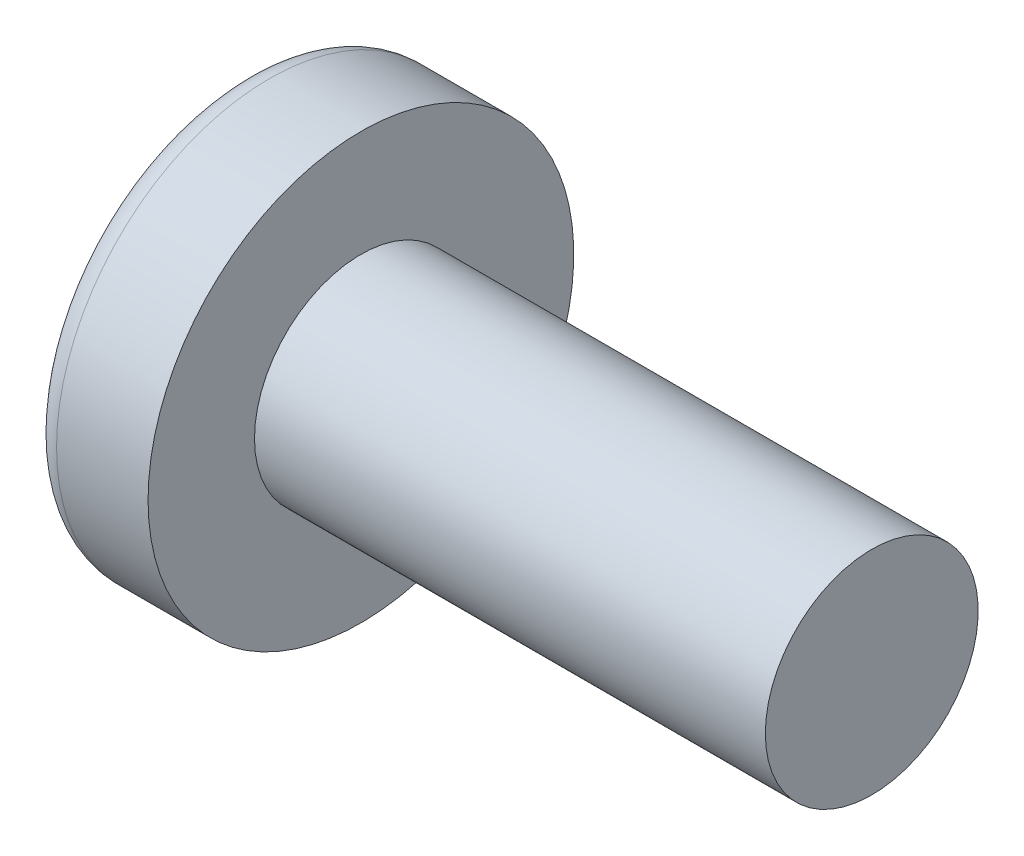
ISO-10303-21;
HEADER;
FILE_DESCRIPTION(('STEP AP214'),'2;1');
FILE_NAME('part.step','',(''),(''),'','','');
FILE_SCHEMA(('AUTOMOTIVE_DESIGN { 1 0 10303 214 1 1 1 1 }'));
ENDSEC;
DATA;
#1=APPLICATION_CONTEXT('core data for automotive mechanical design processes');
#2=APPLICATION_PROTOCOL_DEFINITION('international standard','automotive_design',2000,#1);
#3=PRODUCT_CONTEXT('',#1,'mechanical');
#4=PRODUCT('Part','Part','',(#3));
#5=PRODUCT_RELATED_PRODUCT_CATEGORY('part','',(#4));
#6=PRODUCT_DEFINITION_FORMATION('','',#4);
#7=PRODUCT_DEFINITION_CONTEXT('part definition',#1,'design');
#8=PRODUCT_DEFINITION('design','',#6,#7);
#9=PRODUCT_DEFINITION_SHAPE('','',#8);
#10=(LENGTH_UNIT() NAMED_UNIT(*) SI_UNIT(.MILLI.,.METRE.));
#11=(NAMED_UNIT(*) PLANE_ANGLE_UNIT() SI_UNIT($,.RADIAN.));
#12=(NAMED_UNIT(*) SI_UNIT($,.STERADIAN.) SOLID_ANGLE_UNIT());
#13=UNCERTAINTY_MEASURE_WITH_UNIT(LENGTH_MEASURE(1.E-05),#10,'distance_accuracy_value','');
#14=(GEOMETRIC_REPRESENTATION_CONTEXT(3) GLOBAL_UNCERTAINTY_ASSIGNED_CONTEXT((#13)) GLOBAL_UNIT_ASSIGNED_CONTEXT((#10,
#11,#12)) REPRESENTATION_CONTEXT('',''));
#15=CARTESIAN_POINT('',(0.,0.,0.));
#16=DIRECTION('',(0.,0.,1.));
#17=DIRECTION('',(1.,0.,0.));
#18=AXIS2_PLACEMENT_3D('',#15,#16,#17);
#19=CARTESIAN_POINT('',(4.,0.,0.));
#20=DIRECTION('',(-1.,0.,0.));
#21=DIRECTION('',(0.,1.,0.));
#22=AXIS2_PLACEMENT_3D('',#19,#20,#21);
#23=SPHERICAL_SURFACE('',#22,4.);
#24=CARTESIAN_POINT('',(0.783897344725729,0.,0.));
#25=DIRECTION('',(-1.,0.,0.));
#26=DIRECTION('',(0.,0.,1.));
#27=AXIS2_PLACEMENT_3D('',#24,#25,#26);
#28=CIRCLE('',#27,2.37837837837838);
#29=CARTESIAN_POINT('',(0.783897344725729,0.,2.37837837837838));
#30=VERTEX_POINT('',#29);
#31=EDGE_CURVE('E159',#30,#30,#28,.T.);
#32=ORIENTED_EDGE('',*,*,#31,.T.);
#33=EDGE_LOOP('',(#32));
#34=FACE_BOUND('',#33,.T.);
#35=CARTESIAN_POINT('',(3.98786118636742,-0.106127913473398,0.));
#36=DIRECTION('',(-0.11363816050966,-0.993522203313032,0.));
#37=DIRECTION('',(0.993522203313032,-0.11363816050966,0.));
#38=AXIS2_PLACEMENT_3D('',#35,#36,#37);
#39=CIRCLE('',#38,3.99857343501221);
#40=CARTESIAN_POINT('',(0.195539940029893,0.327634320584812,1.19110847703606));
#41=VERTEX_POINT('',#40);
#42=CARTESIAN_POINT('',(0.0301382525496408,0.346552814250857,0.346552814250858));
#43=VERTEX_POINT('',#42);
#44=EDGE_CURVE('E134',#41,#43,#39,.T.);
#45=ORIENTED_EDGE('',*,*,#44,.F.);
#46=CARTESIAN_POINT('',(3.17784904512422,0.,-1.07973473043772));
#47=DIRECTION('',(0.605808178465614,0.,0.795610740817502));
#48=DIRECTION('',(0.795610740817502,0.,-0.605808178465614));
#49=AXIS2_PLACEMENT_3D('',#46,#47,#48);
#50=CIRCLE('',#49,3.76274377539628);
#51=CARTESIAN_POINT('',(0.195539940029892,-0.32763432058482,1.19110847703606));
#52=VERTEX_POINT('',#51);
#53=EDGE_CURVE('E127',#41,#52,#50,.T.);
#54=ORIENTED_EDGE('',*,*,#53,.T.);
#55=CARTESIAN_POINT('',(3.98786118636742,0.106127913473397,0.));
#56=DIRECTION('',(-0.11363816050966,0.993522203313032,0.));
#57=DIRECTION('',(-0.993522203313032,-0.11363816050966,0.));
#58=AXIS2_PLACEMENT_3D('',#55,#56,#57);
#59=CIRCLE('',#58,3.99857343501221);
#60=CARTESIAN_POINT('',(0.0301382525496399,-0.346552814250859,0.346552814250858));
#61=VERTEX_POINT('',#60);
#62=EDGE_CURVE('E201',#61,#52,#59,.T.);
#63=ORIENTED_EDGE('',*,*,#62,.F.);
#64=CARTESIAN_POINT('',(3.98786118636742,0.,-0.106127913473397));
#65=DIRECTION('',(-0.11363816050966,0.,-0.993522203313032));
#66=DIRECTION('',(-0.993522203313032,0.,0.11363816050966));
#67=AXIS2_PLACEMENT_3D('',#64,#65,#66);
#68=CIRCLE('',#67,3.99857343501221);
#69=CARTESIAN_POINT('',(0.195539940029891,-1.19110847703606,0.327634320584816));
#70=VERTEX_POINT('',#69);
#71=EDGE_CURVE('E176',#70,#61,#68,.T.);
#72=ORIENTED_EDGE('',*,*,#71,.F.);
#73=CARTESIAN_POINT('',(3.17784904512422,1.07973473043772,0.));
#74=DIRECTION('',(0.605808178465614,-0.795610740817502,0.));
#75=DIRECTION('',(0.795610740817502,0.605808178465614,0.));
#76=AXIS2_PLACEMENT_3D('',#73,#74,#75);
#77=CIRCLE('',#76,3.76274377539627);
#78=CARTESIAN_POINT('',(0.195539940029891,-1.19110847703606,-0.327634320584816));
#79=VERTEX_POINT('',#78);
#80=EDGE_CURVE('E172',#70,#79,#77,.T.);
#81=ORIENTED_EDGE('',*,*,#80,.T.);
#82=CARTESIAN_POINT('',(3.98786118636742,0.,0.106127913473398));
#83=DIRECTION('',(-0.11363816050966,0.,0.993522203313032));
#84=DIRECTION('',(0.993522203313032,0.,0.11363816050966));
#85=AXIS2_PLACEMENT_3D('',#82,#83,#84);
#86=CIRCLE('',#85,3.99857343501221);
#87=CARTESIAN_POINT('',(0.0301382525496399,-0.346552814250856,-0.346552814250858));
#88=VERTEX_POINT('',#87);
#89=EDGE_CURVE('E55',#88,#79,#86,.T.);
#90=ORIENTED_EDGE('',*,*,#89,.F.);
#91=CARTESIAN_POINT('',(0.195539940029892,-0.327634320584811,-1.19110847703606));
#92=VERTEX_POINT('',#91);
#93=EDGE_CURVE('E198',#92,#88,#59,.T.);
#94=ORIENTED_EDGE('',*,*,#93,.F.);
#95=CARTESIAN_POINT('',(3.17784904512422,0.,1.07973473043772));
#96=DIRECTION('',(0.605808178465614,0.,-0.795610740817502));
#97=DIRECTION('',(-0.795610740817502,0.,-0.605808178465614));
#98=AXIS2_PLACEMENT_3D('',#95,#96,#97);
#99=CIRCLE('',#98,3.76274377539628);
#100=CARTESIAN_POINT('',(0.195539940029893,0.32763432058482,-1.19110847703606));
#101=VERTEX_POINT('',#100);
#102=EDGE_CURVE('E191',#92,#101,#99,.T.);
#103=ORIENTED_EDGE('',*,*,#102,.T.);
#104=CARTESIAN_POINT('',(0.0301382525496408,0.346552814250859,-0.346552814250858));
#105=VERTEX_POINT('',#104);
#106=EDGE_CURVE('E112',#105,#101,#39,.T.);
#107=ORIENTED_EDGE('',*,*,#106,.F.);
#108=CARTESIAN_POINT('',(0.195539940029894,1.19110847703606,-0.327634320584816));
#109=VERTEX_POINT('',#108);
#110=EDGE_CURVE('E48',#109,#105,#86,.T.);
#111=ORIENTED_EDGE('',*,*,#110,.F.);
#112=CARTESIAN_POINT('',(3.17784904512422,-1.07973473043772,0.));
#113=DIRECTION('',(0.605808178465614,0.795610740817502,0.));
#114=DIRECTION('',(-0.795610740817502,0.605808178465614,0.));
#115=AXIS2_PLACEMENT_3D('',#112,#113,#114);
#116=CIRCLE('',#115,3.76274377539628);
#117=CARTESIAN_POINT('',(0.195539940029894,1.19110847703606,0.327634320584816));
#118=VERTEX_POINT('',#117);
#119=EDGE_CURVE('E11',#109,#118,#116,.T.);
#120=ORIENTED_EDGE('',*,*,#119,.T.);
#121=EDGE_CURVE('E175',#43,#118,#68,.T.);
#122=ORIENTED_EDGE('',*,*,#121,.F.);
#123=EDGE_LOOP('',(#45,#54,#63,#72,#81,#90,#94,#103,#107,#111,#120,#122));
#124=FACE_BOUND('',#123,.T.);
#125=ADVANCED_FACE('F40',(#34,#124),#23,.T.);
#126=CARTESIAN_POINT('',(1.75982832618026,0.,-0.148712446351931));
#127=DIRECTION('',(-0.11363816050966,0.,0.993522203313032));
#128=DIRECTION('',(0.993522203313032,0.,0.11363816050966));
#129=AXIS2_PLACEMENT_3D('',#126,#127,#128);
#130=PLANE('',#129);
#131=ORIENTED_EDGE('',*,*,#110,.T.);
#132=DIRECTION('',(0.987168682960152,-0.112911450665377,0.112911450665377));
#133=VECTOR('',#132,1.);
#134=CARTESIAN_POINT('',(1.77640420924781,0.146816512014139,-0.146816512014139));
#135=LINE('',#134,#133);
#136=CARTESIAN_POINT('',(1.53,0.175000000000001,-0.174999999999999));
#137=VERTEX_POINT('',#136);
#138=EDGE_CURVE('E110',#105,#137,#135,.T.);
#139=ORIENTED_EDGE('',*,*,#138,.T.);
#140=DIRECTION('',(0.792336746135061,-0.603315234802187,0.0906267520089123));
#141=VECTOR('',#140,1.);
#142=CARTESIAN_POINT('',(0.,1.34,-0.35));
#143=LINE('',#142,#141);
#144=EDGE_CURVE('E132',#109,#137,#143,.T.);
#145=ORIENTED_EDGE('',*,*,#144,.F.);
#146=EDGE_LOOP('',(#131,#139,#145));
#147=FACE_BOUND('',#146,.T.);
#148=ADVANCED_FACE('F131',(#147),#130,.T.);
#149=DIRECTION('',(0.792336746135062,0.603315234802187,0.0906267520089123));
#150=VECTOR('',#149,1.);
#151=CARTESIAN_POINT('',(0.,-1.34,-0.35));
#152=LINE('',#151,#150);
#153=CARTESIAN_POINT('',(1.53,-0.175,-0.175));
#154=VERTEX_POINT('',#153);
#155=EDGE_CURVE('E153',#79,#154,#152,.T.);
#156=ORIENTED_EDGE('',*,*,#155,.T.);
#157=DIRECTION('',(-0.987168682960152,-0.112911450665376,-0.112911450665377));
#158=VECTOR('',#157,1.);
#159=CARTESIAN_POINT('',(1.77640420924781,-0.146816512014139,-0.146816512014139));
#160=LINE('',#159,#158);
#161=EDGE_CURVE('E199',#154,#88,#160,.T.);
#162=ORIENTED_EDGE('',*,*,#161,.T.);
#163=ORIENTED_EDGE('',*,*,#89,.T.);
#164=EDGE_LOOP('',(#156,#162,#163));
#165=FACE_BOUND('',#164,.T.);
#166=ADVANCED_FACE('F232',(#165),#130,.T.);
#167=CARTESIAN_POINT('',(1.75982832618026,0.,0.148712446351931));
#168=DIRECTION('',(-0.11363816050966,0.,-0.993522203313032));
#169=DIRECTION('',(-0.993522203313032,0.,0.11363816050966));
#170=AXIS2_PLACEMENT_3D('',#167,#168,#169);
#171=PLANE('',#170);
#172=DIRECTION('',(0.792336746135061,-0.603315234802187,-0.0906267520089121));
#173=VECTOR('',#172,1.);
#174=CARTESIAN_POINT('',(0.,1.34,0.35));
#175=LINE('',#174,#173);
#176=CARTESIAN_POINT('',(1.53,0.175,0.175));
#177=VERTEX_POINT('',#176);
#178=EDGE_CURVE('E139',#118,#177,#175,.T.);
#179=ORIENTED_EDGE('',*,*,#178,.T.);
#180=DIRECTION('',(-0.987168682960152,0.112911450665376,0.112911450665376));
#181=VECTOR('',#180,1.);
#182=CARTESIAN_POINT('',(1.77640420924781,0.146816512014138,0.146816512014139));
#183=LINE('',#182,#181);
#184=EDGE_CURVE('E187',#177,#43,#183,.T.);
#185=ORIENTED_EDGE('',*,*,#184,.T.);
#186=ORIENTED_EDGE('',*,*,#121,.T.);
#187=EDGE_LOOP('',(#179,#185,#186));
#188=FACE_BOUND('',#187,.T.);
#189=ADVANCED_FACE('F185',(#188),#171,.T.);
#190=ORIENTED_EDGE('',*,*,#71,.T.);
#191=DIRECTION('',(0.987168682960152,0.112911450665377,-0.112911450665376));
#192=VECTOR('',#191,1.);
#193=CARTESIAN_POINT('',(1.77640420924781,-0.14681651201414,0.146816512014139));
#194=LINE('',#193,#192);
#195=CARTESIAN_POINT('',(1.53,-0.175000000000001,0.174999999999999));
#196=VERTEX_POINT('',#195);
#197=EDGE_CURVE('E204',#61,#196,#194,.T.);
#198=ORIENTED_EDGE('',*,*,#197,.T.);
#199=DIRECTION('',(0.792336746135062,0.603315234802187,-0.0906267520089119));
#200=VECTOR('',#199,1.);
#201=CARTESIAN_POINT('',(0.,-1.34,0.349999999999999));
#202=LINE('',#201,#200);
#203=EDGE_CURVE('E150',#70,#196,#202,.T.);
#204=ORIENTED_EDGE('',*,*,#203,.F.);
#205=EDGE_LOOP('',(#190,#198,#204));
#206=FACE_BOUND('',#205,.T.);
#207=ADVANCED_FACE('F251',(#206),#171,.T.);
#208=CARTESIAN_POINT('',(-25.4,0.,0.));
#209=DIRECTION('',(-1.,0.,0.));
#210=DIRECTION('',(0.,0.,1.));
#211=AXIS2_PLACEMENT_3D('',#208,#209,#210);
#212=CYLINDRICAL_SURFACE('',#211,1.25);
#213=CARTESIAN_POINT('',(8.1,0.,0.));
#214=DIRECTION('',(-1.,0.,0.));
#215=DIRECTION('',(0.,0.,1.));
#216=AXIS2_PLACEMENT_3D('',#213,#214,#215);
#217=CIRCLE('',#216,1.25);
#218=CARTESIAN_POINT('',(8.1,0.,1.25));
#219=VERTEX_POINT('',#218);
#220=EDGE_CURVE('E138',#219,#219,#217,.T.);
#221=ORIENTED_EDGE('',*,*,#220,.T.);
#222=EDGE_LOOP('',(#221));
#223=FACE_BOUND('',#222,.T.);
#224=CARTESIAN_POINT('',(2.1,0.,0.));
#225=DIRECTION('',(-1.,0.,0.));
#226=DIRECTION('',(0.,0.,1.));
#227=AXIS2_PLACEMENT_3D('',#224,#225,#226);
#228=CIRCLE('',#227,1.25);
#229=CARTESIAN_POINT('',(2.1,0.,1.25));
#230=VERTEX_POINT('',#229);
#231=EDGE_CURVE('E169',#230,#230,#228,.T.);
#232=ORIENTED_EDGE('',*,*,#231,.F.);
#233=EDGE_LOOP('',(#232));
#234=FACE_BOUND('',#233,.T.);
#235=ADVANCED_FACE('F42',(#223,#234),#212,.T.);
#236=CARTESIAN_POINT('',(2.1,1.25,0.));
#237=DIRECTION('',(-1.,0.,0.));
#238=DIRECTION('',(0.,0.,1.));
#239=AXIS2_PLACEMENT_3D('',#236,#237,#238);
#240=PLANE('',#239);
#241=CARTESIAN_POINT('',(2.1,0.,0.));
#242=DIRECTION('',(-1.,0.,0.));
#243=DIRECTION('',(0.,0.,1.));
#244=AXIS2_PLACEMENT_3D('',#241,#242,#243);
#245=CIRCLE('',#244,2.5);
#246=CARTESIAN_POINT('',(2.1,0.,2.5));
#247=VERTEX_POINT('',#246);
#248=EDGE_CURVE('E165',#247,#247,#245,.T.);
#249=ORIENTED_EDGE('',*,*,#248,.F.);
#250=EDGE_LOOP('',(#249));
#251=FACE_BOUND('',#250,.T.);
#252=ORIENTED_EDGE('',*,*,#231,.T.);
#253=EDGE_LOOP('',(#252));
#254=FACE_BOUND('',#253,.T.);
#255=ADVANCED_FACE('F244',(#251,#254),#240,.F.);
#256=CARTESIAN_POINT('',(-25.4,0.,0.));
#257=DIRECTION('',(-1.,0.,0.));
#258=DIRECTION('',(0.,0.,1.));
#259=AXIS2_PLACEMENT_3D('',#256,#257,#258);
#260=CYLINDRICAL_SURFACE('',#259,2.5);
#261=ORIENTED_EDGE('',*,*,#248,.T.);
#262=EDGE_LOOP('',(#261));
#263=FACE_BOUND('',#262,.T.);
#264=CARTESIAN_POINT('',(1.0251050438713,0.,0.));
#265=DIRECTION('',(-1.,0.,0.));
#266=DIRECTION('',(0.,0.,1.));
#267=AXIS2_PLACEMENT_3D('',#264,#265,#266);
#268=CIRCLE('',#267,2.5);
#269=CARTESIAN_POINT('',(1.0251050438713,0.,2.5));
#270=VERTEX_POINT('',#269);
#271=EDGE_CURVE('E162',#270,#270,#268,.T.);
#272=ORIENTED_EDGE('',*,*,#271,.F.);
#273=EDGE_LOOP('',(#272));
#274=FACE_BOUND('',#273,.T.);
#275=ADVANCED_FACE('F241',(#263,#274),#260,.T.);
#276=CARTESIAN_POINT('',(1.0251050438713,0.,0.));
#277=DIRECTION('',(-1.,0.,0.));
#278=DIRECTION('',(0.,0.,1.));
#279=AXIS2_PLACEMENT_3D('',#276,#277,#278);
#280=TOROIDAL_SURFACE('',#279,2.2,0.3);
#281=ORIENTED_EDGE('',*,*,#271,.T.);
#282=EDGE_LOOP('',(#281));
#283=FACE_BOUND('',#282,.T.);
#284=ORIENTED_EDGE('',*,*,#31,.F.);
#285=EDGE_LOOP('',(#284));
#286=FACE_BOUND('',#285,.T.);
#287=ADVANCED_FACE('F238',(#283,#286),#280,.T.);
#288=CARTESIAN_POINT('',(8.1,1.25,0.));
#289=DIRECTION('',(1.,0.,0.));
#290=DIRECTION('',(0.,0.,-1.));
#291=AXIS2_PLACEMENT_3D('',#288,#289,#290);
#292=PLANE('',#291);
#293=ORIENTED_EDGE('',*,*,#220,.F.);
#294=EDGE_LOOP('',(#293));
#295=FACE_BOUND('',#294,.T.);
#296=ADVANCED_FACE('F236',(#295),#292,.T.);
#297=CARTESIAN_POINT('',(0.,1.34,0.35));
#298=DIRECTION('',(0.605808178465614,0.795610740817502,0.));
#299=DIRECTION('',(-0.795610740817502,0.605808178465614,0.));
#300=AXIS2_PLACEMENT_3D('',#297,#298,#299);
#301=PLANE('',#300);
#302=ORIENTED_EDGE('',*,*,#144,.T.);
#303=DIRECTION('',(0.,0.,-1.));
#304=VECTOR('',#303,1.);
#305=CARTESIAN_POINT('',(1.53,0.175,0.175));
#306=LINE('',#305,#304);
#307=EDGE_CURVE('E126',#177,#137,#306,.T.);
#308=ORIENTED_EDGE('',*,*,#307,.F.);
#309=ORIENTED_EDGE('',*,*,#178,.F.);
#310=ORIENTED_EDGE('',*,*,#119,.F.);
#311=EDGE_LOOP('',(#302,#308,#309,#310));
#312=FACE_BOUND('',#311,.T.);
#313=ADVANCED_FACE('F137',(#312),#301,.F.);
#314=CARTESIAN_POINT('',(0.,-1.34,-0.35));
#315=DIRECTION('',(0.605808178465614,-0.795610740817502,0.));
#316=DIRECTION('',(0.795610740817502,0.605808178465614,0.));
#317=AXIS2_PLACEMENT_3D('',#314,#315,#316);
#318=PLANE('',#317);
#319=ORIENTED_EDGE('',*,*,#203,.T.);
#320=DIRECTION('',(0.,0.,1.));
#321=VECTOR('',#320,1.);
#322=CARTESIAN_POINT('',(1.53,-0.175,-0.175));
#323=LINE('',#322,#321);
#324=EDGE_CURVE('E146',#154,#196,#323,.T.);
#325=ORIENTED_EDGE('',*,*,#324,.F.);
#326=ORIENTED_EDGE('',*,*,#155,.F.);
#327=ORIENTED_EDGE('',*,*,#80,.F.);
#328=EDGE_LOOP('',(#319,#325,#326,#327));
#329=FACE_BOUND('',#328,.T.);
#330=ADVANCED_FACE('F271',(#329),#318,.F.);
#331=CARTESIAN_POINT('',(1.53,0.175,-0.175));
#332=DIRECTION('',(-1.,0.,0.));
#333=DIRECTION('',(0.,0.,1.));
#334=AXIS2_PLACEMENT_3D('',#331,#332,#333);
#335=PLANE('',#334);
#336=DIRECTION('',(0.,1.,0.));
#337=VECTOR('',#336,1.);
#338=CARTESIAN_POINT('',(1.53,-0.175,-0.175));
#339=LINE('',#338,#337);
#340=EDGE_CURVE('E119',#154,#137,#339,.T.);
#341=ORIENTED_EDGE('',*,*,#340,.F.);
#342=ORIENTED_EDGE('',*,*,#324,.T.);
#343=DIRECTION('',(0.,-1.,0.));
#344=VECTOR('',#343,1.);
#345=CARTESIAN_POINT('',(1.53,0.175,0.175));
#346=LINE('',#345,#344);
#347=EDGE_CURVE('E144',#177,#196,#346,.T.);
#348=ORIENTED_EDGE('',*,*,#347,.F.);
#349=ORIENTED_EDGE('',*,*,#307,.T.);
#350=EDGE_LOOP('',(#341,#342,#348,#349));
#351=FACE_BOUND('',#350,.T.);
#352=ADVANCED_FACE('F142',(#351),#335,.T.);
#353=CARTESIAN_POINT('',(0.,0.350000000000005,-1.34));
#354=DIRECTION('',(0.605808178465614,0.,-0.795610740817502));
#355=DIRECTION('',(0.795610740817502,0.,0.605808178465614));
#356=AXIS2_PLACEMENT_3D('',#353,#354,#355);
#357=PLANE('',#356);
#358=DIRECTION('',(0.792336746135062,0.0906267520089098,0.603315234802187));
#359=VECTOR('',#358,1.);
#360=CARTESIAN_POINT('',(0.,-0.349999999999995,-1.34));
#361=LINE('',#360,#359);
#362=EDGE_CURVE('E116',#92,#154,#361,.T.);
#363=ORIENTED_EDGE('',*,*,#362,.T.);
#364=ORIENTED_EDGE('',*,*,#340,.T.);
#365=DIRECTION('',(0.792336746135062,-0.0906267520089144,0.603315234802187));
#366=VECTOR('',#365,1.);
#367=CARTESIAN_POINT('',(0.,0.350000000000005,-1.34));
#368=LINE('',#367,#366);
#369=EDGE_CURVE('E106',#101,#137,#368,.T.);
#370=ORIENTED_EDGE('',*,*,#369,.F.);
#371=ORIENTED_EDGE('',*,*,#102,.F.);
#372=EDGE_LOOP('',(#363,#364,#370,#371));
#373=FACE_BOUND('',#372,.T.);
#374=ADVANCED_FACE('F120',(#373),#357,.F.);
#375=CARTESIAN_POINT('',(1.75982832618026,-0.148712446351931,0.));
#376=DIRECTION('',(-0.11363816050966,0.993522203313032,0.));
#377=DIRECTION('',(-0.993522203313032,-0.11363816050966,0.));
#378=AXIS2_PLACEMENT_3D('',#375,#376,#377);
#379=PLANE('',#378);
#380=ORIENTED_EDGE('',*,*,#93,.T.);
#381=ORIENTED_EDGE('',*,*,#161,.F.);
#382=ORIENTED_EDGE('',*,*,#362,.F.);
#383=EDGE_LOOP('',(#380,#381,#382));
#384=FACE_BOUND('',#383,.T.);
#385=ADVANCED_FACE('F223',(#384),#379,.T.);
#386=CARTESIAN_POINT('',(1.75982832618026,0.148712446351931,0.));
#387=DIRECTION('',(-0.11363816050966,-0.993522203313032,0.));
#388=DIRECTION('',(0.993522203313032,-0.11363816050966,0.));
#389=AXIS2_PLACEMENT_3D('',#386,#387,#388);
#390=PLANE('',#389);
#391=ORIENTED_EDGE('',*,*,#106,.T.);
#392=ORIENTED_EDGE('',*,*,#369,.T.);
#393=ORIENTED_EDGE('',*,*,#138,.F.);
#394=EDGE_LOOP('',(#391,#392,#393));
#395=FACE_BOUND('',#394,.T.);
#396=ADVANCED_FACE('F108',(#395),#390,.T.);
#397=CARTESIAN_POINT('',(0.,-0.350000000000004,1.34));
#398=DIRECTION('',(0.605808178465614,0.,0.795610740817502));
#399=DIRECTION('',(-0.795610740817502,0.,0.605808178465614));
#400=AXIS2_PLACEMENT_3D('',#397,#398,#399);
#401=PLANE('',#400);
#402=DIRECTION('',(0.792336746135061,-0.0906267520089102,-0.603315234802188));
#403=VECTOR('',#402,1.);
#404=CARTESIAN_POINT('',(0.,0.349999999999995,1.34));
#405=LINE('',#404,#403);
#406=EDGE_CURVE('E207',#41,#177,#405,.T.);
#407=ORIENTED_EDGE('',*,*,#406,.T.);
#408=ORIENTED_EDGE('',*,*,#347,.T.);
#409=DIRECTION('',(0.792336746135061,0.0906267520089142,-0.603315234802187));
#410=VECTOR('',#409,1.);
#411=CARTESIAN_POINT('',(0.,-0.350000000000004,1.34));
#412=LINE('',#411,#410);
#413=EDGE_CURVE('E115',#52,#196,#412,.T.);
#414=ORIENTED_EDGE('',*,*,#413,.F.);
#415=ORIENTED_EDGE('',*,*,#53,.F.);
#416=EDGE_LOOP('',(#407,#408,#414,#415));
#417=FACE_BOUND('',#416,.T.);
#418=ADVANCED_FACE('F211',(#417),#401,.F.);
#419=ORIENTED_EDGE('',*,*,#44,.T.);
#420=ORIENTED_EDGE('',*,*,#184,.F.);
#421=ORIENTED_EDGE('',*,*,#406,.F.);
#422=EDGE_LOOP('',(#419,#420,#421));
#423=FACE_BOUND('',#422,.T.);
#424=ADVANCED_FACE('F213',(#423),#390,.T.);
#425=ORIENTED_EDGE('',*,*,#62,.T.);
#426=ORIENTED_EDGE('',*,*,#413,.T.);
#427=ORIENTED_EDGE('',*,*,#197,.F.);
#428=EDGE_LOOP('',(#425,#426,#427));
#429=FACE_BOUND('',#428,.T.);
#430=ADVANCED_FACE('F215',(#429),#379,.T.);
#431=CLOSED_SHELL('',(#125,#148,#166,#189,#207,#235,#255,#275,#287,#296,#313,#330,#352,#374,
#385,#396,#418,#424,#430));
#432=MANIFOLD_SOLID_BREP('B2',#431);
#433=ADVANCED_BREP_SHAPE_REPRESENTATION('',(#18,#432),#14);
#434=SHAPE_DEFINITION_REPRESENTATION(#9,#433);
ENDSEC;
END-ISO-10303-21;
